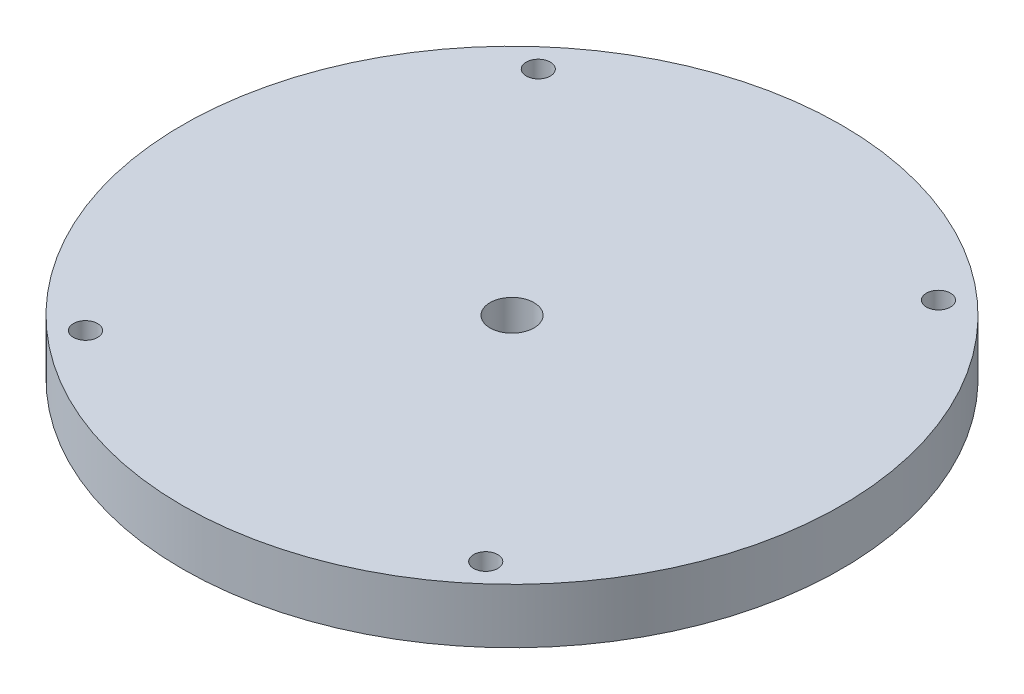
ISO-10303-21;
HEADER;
FILE_DESCRIPTION(('STEP AP214'),'2;1');
FILE_NAME('part.step','',(''),(''),'','','');
FILE_SCHEMA(('AUTOMOTIVE_DESIGN { 1 0 10303 214 1 1 1 1 }'));
ENDSEC;
DATA;
#1=APPLICATION_CONTEXT('core data for automotive mechanical design processes');
#2=APPLICATION_PROTOCOL_DEFINITION('international standard','automotive_design',2000,#1);
#3=PRODUCT_CONTEXT('',#1,'mechanical');
#4=PRODUCT('Part','Part','',(#3));
#5=PRODUCT_RELATED_PRODUCT_CATEGORY('part','',(#4));
#6=PRODUCT_DEFINITION_FORMATION('','',#4);
#7=PRODUCT_DEFINITION_CONTEXT('part definition',#1,'design');
#8=PRODUCT_DEFINITION('design','',#6,#7);
#9=PRODUCT_DEFINITION_SHAPE('','',#8);
#10=(LENGTH_UNIT() NAMED_UNIT(*) SI_UNIT(.MILLI.,.METRE.));
#11=(NAMED_UNIT(*) PLANE_ANGLE_UNIT() SI_UNIT($,.RADIAN.));
#12=(NAMED_UNIT(*) SI_UNIT($,.STERADIAN.) SOLID_ANGLE_UNIT());
#13=UNCERTAINTY_MEASURE_WITH_UNIT(LENGTH_MEASURE(1.E-05),#10,'distance_accuracy_value','');
#14=(GEOMETRIC_REPRESENTATION_CONTEXT(3) GLOBAL_UNCERTAINTY_ASSIGNED_CONTEXT((#13)) GLOBAL_UNIT_ASSIGNED_CONTEXT((#10,
#11,#12)) REPRESENTATION_CONTEXT('',''));
#15=CARTESIAN_POINT('',(0.,0.,0.));
#16=DIRECTION('',(0.,0.,1.));
#17=DIRECTION('',(1.,0.,0.));
#18=AXIS2_PLACEMENT_3D('',#15,#16,#17);
#19=CARTESIAN_POINT('',(0.,10.,0.));
#20=DIRECTION('',(0.,1.,0.));
#21=DIRECTION('',(0.,0.,1.));
#22=AXIS2_PLACEMENT_3D('',#19,#20,#21);
#23=PLANE('',#22);
#24=CARTESIAN_POINT('',(-36.4296575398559,10.,41.2180144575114));
#25=DIRECTION('',(0.,1.,0.));
#26=DIRECTION('',(0.,0.,1.));
#27=AXIS2_PLACEMENT_3D('',#24,#25,#26);
#28=CIRCLE('',#27,2.2);
#29=CARTESIAN_POINT('',(-36.4296575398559,10.,43.4180144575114));
#30=VERTEX_POINT('',#29);
#31=EDGE_CURVE('E59',#30,#30,#28,.T.);
#32=ORIENTED_EDGE('',*,*,#31,.F.);
#33=EDGE_LOOP('',(#32));
#34=FACE_BOUND('',#33,.T.);
#35=CARTESIAN_POINT('',(-36.4296575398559,10.,-41.2180144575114));
#36=DIRECTION('',(0.,1.,0.));
#37=DIRECTION('',(0.,0.,1.));
#38=AXIS2_PLACEMENT_3D('',#35,#36,#37);
#39=CIRCLE('',#38,2.2);
#40=CARTESIAN_POINT('',(-36.4296575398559,10.,-39.0180144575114));
#41=VERTEX_POINT('',#40);
#42=EDGE_CURVE('E47',#41,#41,#39,.T.);
#43=ORIENTED_EDGE('',*,*,#42,.F.);
#44=EDGE_LOOP('',(#43));
#45=FACE_BOUND('',#44,.T.);
#46=CARTESIAN_POINT('',(0.,10.,0.));
#47=DIRECTION('',(0.,1.,0.));
#48=DIRECTION('',(0.,0.,1.));
#49=AXIS2_PLACEMENT_3D('',#46,#47,#48);
#50=CIRCLE('',#49,60.);
#51=CARTESIAN_POINT('',(0.,10.,60.));
#52=VERTEX_POINT('',#51);
#53=EDGE_CURVE('E10',#52,#52,#50,.T.);
#54=ORIENTED_EDGE('',*,*,#53,.T.);
#55=EDGE_LOOP('',(#54));
#56=FACE_BOUND('',#55,.T.);
#57=CARTESIAN_POINT('',(0.,10.,0.));
#58=DIRECTION('',(0.,1.,0.));
#59=DIRECTION('',(0.,0.,1.));
#60=AXIS2_PLACEMENT_3D('',#57,#58,#59);
#61=CIRCLE('',#60,4.);
#62=CARTESIAN_POINT('',(0.,10.,4.));
#63=VERTEX_POINT('',#62);
#64=EDGE_CURVE('E42',#63,#63,#61,.T.);
#65=ORIENTED_EDGE('',*,*,#64,.F.);
#66=EDGE_LOOP('',(#65));
#67=FACE_BOUND('',#66,.T.);
#68=CARTESIAN_POINT('',(36.4296575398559,10.,-41.2180144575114));
#69=DIRECTION('',(0.,1.,0.));
#70=DIRECTION('',(0.,0.,1.));
#71=AXIS2_PLACEMENT_3D('',#68,#69,#70);
#72=CIRCLE('',#71,2.2);
#73=CARTESIAN_POINT('',(36.4296575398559,10.,-39.0180144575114));
#74=VERTEX_POINT('',#73);
#75=EDGE_CURVE('E53',#74,#74,#72,.T.);
#76=ORIENTED_EDGE('',*,*,#75,.F.);
#77=EDGE_LOOP('',(#76));
#78=FACE_BOUND('',#77,.T.);
#79=CARTESIAN_POINT('',(36.4296575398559,10.,41.2180144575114));
#80=DIRECTION('',(0.,1.,0.));
#81=DIRECTION('',(0.,0.,1.));
#82=AXIS2_PLACEMENT_3D('',#79,#80,#81);
#83=CIRCLE('',#82,2.2);
#84=CARTESIAN_POINT('',(36.4296575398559,10.,43.4180144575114));
#85=VERTEX_POINT('',#84);
#86=EDGE_CURVE('E65',#85,#85,#83,.T.);
#87=ORIENTED_EDGE('',*,*,#86,.F.);
#88=EDGE_LOOP('',(#87));
#89=FACE_BOUND('',#88,.T.);
#90=ADVANCED_FACE('F31',(#34,#45,#56,#67,#78,#89),#23,.T.);
#91=CARTESIAN_POINT('',(0.,0.,0.));
#92=DIRECTION('',(0.,1.,0.));
#93=DIRECTION('',(0.,0.,1.));
#94=AXIS2_PLACEMENT_3D('',#91,#92,#93);
#95=PLANE('',#94);
#96=CARTESIAN_POINT('',(-36.4296575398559,0.,41.2180144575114));
#97=DIRECTION('',(0.,1.,0.));
#98=DIRECTION('',(0.,0.,1.));
#99=AXIS2_PLACEMENT_3D('',#96,#97,#98);
#100=CIRCLE('',#99,2.2);
#101=CARTESIAN_POINT('',(-36.4296575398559,0.,43.4180144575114));
#102=VERTEX_POINT('',#101);
#103=EDGE_CURVE('E62',#102,#102,#100,.T.);
#104=ORIENTED_EDGE('',*,*,#103,.T.);
#105=EDGE_LOOP('',(#104));
#106=FACE_BOUND('',#105,.T.);
#107=CARTESIAN_POINT('',(-36.4296575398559,0.,-41.2180144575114));
#108=DIRECTION('',(0.,1.,0.));
#109=DIRECTION('',(0.,0.,1.));
#110=AXIS2_PLACEMENT_3D('',#107,#108,#109);
#111=CIRCLE('',#110,2.2);
#112=CARTESIAN_POINT('',(-36.4296575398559,0.,-39.0180144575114));
#113=VERTEX_POINT('',#112);
#114=EDGE_CURVE('E50',#113,#113,#111,.T.);
#115=ORIENTED_EDGE('',*,*,#114,.T.);
#116=EDGE_LOOP('',(#115));
#117=FACE_BOUND('',#116,.T.);
#118=CARTESIAN_POINT('',(0.,0.,0.));
#119=DIRECTION('',(0.,1.,0.));
#120=DIRECTION('',(0.,0.,1.));
#121=AXIS2_PLACEMENT_3D('',#118,#119,#120);
#122=CIRCLE('',#121,60.);
#123=CARTESIAN_POINT('',(0.,0.,60.));
#124=VERTEX_POINT('',#123);
#125=EDGE_CURVE('E35',#124,#124,#122,.T.);
#126=ORIENTED_EDGE('',*,*,#125,.F.);
#127=EDGE_LOOP('',(#126));
#128=FACE_BOUND('',#127,.T.);
#129=CARTESIAN_POINT('',(0.,0.,0.));
#130=DIRECTION('',(0.,1.,0.));
#131=DIRECTION('',(0.,0.,1.));
#132=AXIS2_PLACEMENT_3D('',#129,#130,#131);
#133=CIRCLE('',#132,4.);
#134=CARTESIAN_POINT('',(0.,0.,4.));
#135=VERTEX_POINT('',#134);
#136=EDGE_CURVE('E44',#135,#135,#133,.T.);
#137=ORIENTED_EDGE('',*,*,#136,.T.);
#138=EDGE_LOOP('',(#137));
#139=FACE_BOUND('',#138,.T.);
#140=CARTESIAN_POINT('',(36.4296575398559,0.,-41.2180144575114));
#141=DIRECTION('',(0.,1.,0.));
#142=DIRECTION('',(0.,0.,1.));
#143=AXIS2_PLACEMENT_3D('',#140,#141,#142);
#144=CIRCLE('',#143,2.2);
#145=CARTESIAN_POINT('',(36.4296575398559,0.,-39.0180144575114));
#146=VERTEX_POINT('',#145);
#147=EDGE_CURVE('E56',#146,#146,#144,.T.);
#148=ORIENTED_EDGE('',*,*,#147,.T.);
#149=EDGE_LOOP('',(#148));
#150=FACE_BOUND('',#149,.T.);
#151=CARTESIAN_POINT('',(36.4296575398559,0.,41.2180144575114));
#152=DIRECTION('',(0.,1.,0.));
#153=DIRECTION('',(0.,0.,1.));
#154=AXIS2_PLACEMENT_3D('',#151,#152,#153);
#155=CIRCLE('',#154,2.2);
#156=CARTESIAN_POINT('',(36.4296575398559,0.,43.4180144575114));
#157=VERTEX_POINT('',#156);
#158=EDGE_CURVE('E68',#157,#157,#155,.T.);
#159=ORIENTED_EDGE('',*,*,#158,.T.);
#160=EDGE_LOOP('',(#159));
#161=FACE_BOUND('',#160,.T.);
#162=ADVANCED_FACE('F78',(#106,#117,#128,#139,#150,#161),#95,.F.);
#163=CARTESIAN_POINT('',(0.,10.,0.));
#164=DIRECTION('',(0.,-1.,0.));
#165=DIRECTION('',(0.,0.,-1.));
#166=AXIS2_PLACEMENT_3D('',#163,#164,#165);
#167=CYLINDRICAL_SURFACE('',#166,60.);
#168=ORIENTED_EDGE('',*,*,#53,.F.);
#169=EDGE_LOOP('',(#168));
#170=FACE_BOUND('',#169,.T.);
#171=ORIENTED_EDGE('',*,*,#125,.T.);
#172=EDGE_LOOP('',(#171));
#173=FACE_BOUND('',#172,.T.);
#174=ADVANCED_FACE('F33',(#170,#173),#167,.T.);
#175=CARTESIAN_POINT('',(0.,10.,0.));
#176=DIRECTION('',(0.,-1.,0.));
#177=DIRECTION('',(0.,0.,-1.));
#178=AXIS2_PLACEMENT_3D('',#175,#176,#177);
#179=CYLINDRICAL_SURFACE('',#178,4.);
#180=ORIENTED_EDGE('',*,*,#64,.T.);
#181=EDGE_LOOP('',(#180));
#182=FACE_BOUND('',#181,.T.);
#183=ORIENTED_EDGE('',*,*,#136,.F.);
#184=EDGE_LOOP('',(#183));
#185=FACE_BOUND('',#184,.T.);
#186=ADVANCED_FACE('F88',(#182,#185),#179,.F.);
#187=CARTESIAN_POINT('',(-36.4296575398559,10.,-41.2180144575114));
#188=DIRECTION('',(0.,-1.,0.));
#189=DIRECTION('',(0.,0.,-1.));
#190=AXIS2_PLACEMENT_3D('',#187,#188,#189);
#191=CYLINDRICAL_SURFACE('',#190,2.2);
#192=ORIENTED_EDGE('',*,*,#42,.T.);
#193=EDGE_LOOP('',(#192));
#194=FACE_BOUND('',#193,.T.);
#195=ORIENTED_EDGE('',*,*,#114,.F.);
#196=EDGE_LOOP('',(#195));
#197=FACE_BOUND('',#196,.T.);
#198=ADVANCED_FACE('F91',(#194,#197),#191,.F.);
#199=CARTESIAN_POINT('',(36.4296575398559,10.,-41.2180144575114));
#200=DIRECTION('',(0.,-1.,0.));
#201=DIRECTION('',(0.,0.,-1.));
#202=AXIS2_PLACEMENT_3D('',#199,#200,#201);
#203=CYLINDRICAL_SURFACE('',#202,2.2);
#204=ORIENTED_EDGE('',*,*,#75,.T.);
#205=EDGE_LOOP('',(#204));
#206=FACE_BOUND('',#205,.T.);
#207=ORIENTED_EDGE('',*,*,#147,.F.);
#208=EDGE_LOOP('',(#207));
#209=FACE_BOUND('',#208,.T.);
#210=ADVANCED_FACE('F95',(#206,#209),#203,.F.);
#211=CARTESIAN_POINT('',(-36.4296575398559,10.,41.2180144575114));
#212=DIRECTION('',(0.,-1.,0.));
#213=DIRECTION('',(0.,0.,-1.));
#214=AXIS2_PLACEMENT_3D('',#211,#212,#213);
#215=CYLINDRICAL_SURFACE('',#214,2.2);
#216=ORIENTED_EDGE('',*,*,#31,.T.);
#217=EDGE_LOOP('',(#216));
#218=FACE_BOUND('',#217,.T.);
#219=ORIENTED_EDGE('',*,*,#103,.F.);
#220=EDGE_LOOP('',(#219));
#221=FACE_BOUND('',#220,.T.);
#222=ADVANCED_FACE('F99',(#218,#221),#215,.F.);
#223=CARTESIAN_POINT('',(36.4296575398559,10.,41.2180144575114));
#224=DIRECTION('',(0.,-1.,0.));
#225=DIRECTION('',(0.,0.,-1.));
#226=AXIS2_PLACEMENT_3D('',#223,#224,#225);
#227=CYLINDRICAL_SURFACE('',#226,2.2);
#228=ORIENTED_EDGE('',*,*,#86,.T.);
#229=EDGE_LOOP('',(#228));
#230=FACE_BOUND('',#229,.T.);
#231=ORIENTED_EDGE('',*,*,#158,.F.);
#232=EDGE_LOOP('',(#231));
#233=FACE_BOUND('',#232,.T.);
#234=ADVANCED_FACE('F74',(#230,#233),#227,.F.);
#235=CLOSED_SHELL('',(#90,#162,#174,#186,#198,#210,#222,#234));
#236=MANIFOLD_SOLID_BREP('B2',#235);
#237=ADVANCED_BREP_SHAPE_REPRESENTATION('',(#18,#236),#14);
#238=SHAPE_DEFINITION_REPRESENTATION(#9,#237);
ENDSEC;
END-ISO-10303-21;
